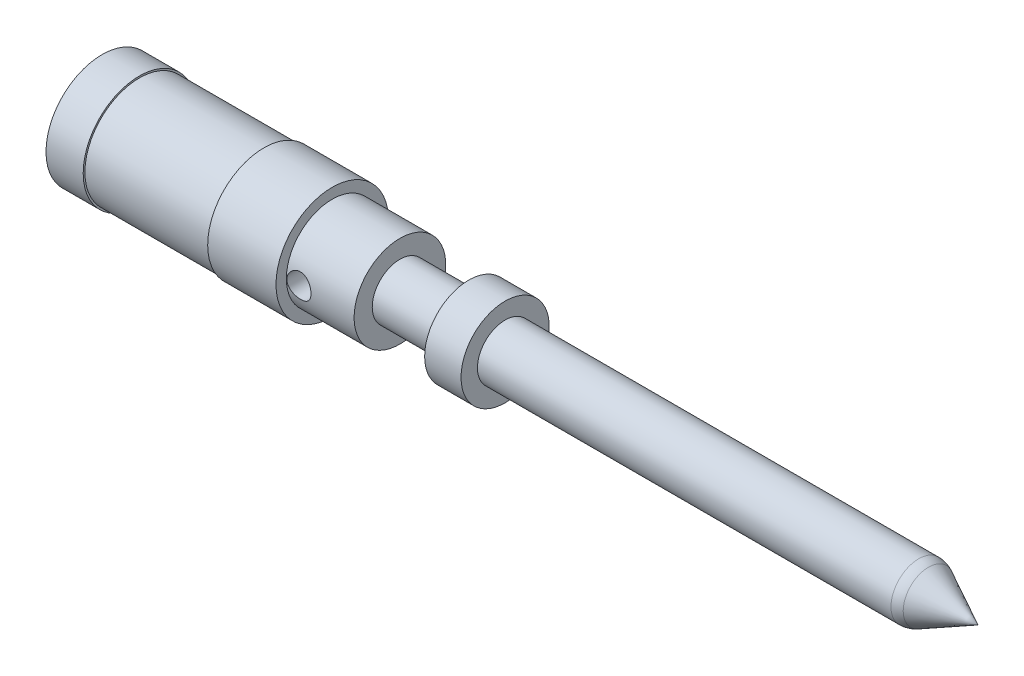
ISO-10303-21;
HEADER;
FILE_DESCRIPTION(('STEP AP214'),'2;1');
FILE_NAME('part.step','',(''),(''),'','','');
FILE_SCHEMA(('AUTOMOTIVE_DESIGN { 1 0 10303 214 1 1 1 1 }'));
ENDSEC;
DATA;
#1=APPLICATION_CONTEXT('core data for automotive mechanical design processes');
#2=APPLICATION_PROTOCOL_DEFINITION('international standard','automotive_design',2000,#1);
#3=PRODUCT_CONTEXT('',#1,'mechanical');
#4=PRODUCT('Part','Part','',(#3));
#5=PRODUCT_RELATED_PRODUCT_CATEGORY('part','',(#4));
#6=PRODUCT_DEFINITION_FORMATION('','',#4);
#7=PRODUCT_DEFINITION_CONTEXT('part definition',#1,'design');
#8=PRODUCT_DEFINITION('design','',#6,#7);
#9=PRODUCT_DEFINITION_SHAPE('','',#8);
#10=(LENGTH_UNIT() NAMED_UNIT(*) SI_UNIT(.MILLI.,.METRE.));
#11=(NAMED_UNIT(*) PLANE_ANGLE_UNIT() SI_UNIT($,.RADIAN.));
#12=(NAMED_UNIT(*) SI_UNIT($,.STERADIAN.) SOLID_ANGLE_UNIT());
#13=UNCERTAINTY_MEASURE_WITH_UNIT(LENGTH_MEASURE(1.E-05),#10,'distance_accuracy_value','');
#14=(GEOMETRIC_REPRESENTATION_CONTEXT(3) GLOBAL_UNCERTAINTY_ASSIGNED_CONTEXT((#13)) GLOBAL_UNIT_ASSIGNED_CONTEXT((#10,
#11,#12)) REPRESENTATION_CONTEXT('',''));
#15=CARTESIAN_POINT('',(0.,0.,0.));
#16=DIRECTION('',(0.,0.,1.));
#17=DIRECTION('',(1.,0.,0.));
#18=AXIS2_PLACEMENT_3D('',#15,#16,#17);
#19=CARTESIAN_POINT('',(0.,0.,0.));
#20=DIRECTION('',(-1.,0.,0.));
#21=DIRECTION('',(0.,0.,1.));
#22=AXIS2_PLACEMENT_3D('',#19,#20,#21);
#23=CYLINDRICAL_SURFACE('',#22,1.3462);
#24=CARTESIAN_POINT('',(6.02176145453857,0.,0.));
#25=DIRECTION('',(-1.,0.,0.));
#26=DIRECTION('',(0.,0.,1.));
#27=AXIS2_PLACEMENT_3D('',#24,#25,#26);
#28=CIRCLE('',#27,1.3462);
#29=CARTESIAN_POINT('',(6.02176145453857,0.,1.3462));
#30=VERTEX_POINT('',#29);
#31=EDGE_CURVE('E159',#30,#30,#28,.T.);
#32=ORIENTED_EDGE('',*,*,#31,.F.);
#33=EDGE_LOOP('',(#32));
#34=FACE_BOUND('',#33,.T.);
#35=CARTESIAN_POINT('',(8.0110066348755,0.,0.));
#36=DIRECTION('',(-1.,0.,0.));
#37=DIRECTION('',(0.,0.,1.));
#38=AXIS2_PLACEMENT_3D('',#35,#36,#37);
#39=CIRCLE('',#38,1.3462);
#40=CARTESIAN_POINT('',(8.0110066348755,0.,1.3462));
#41=VERTEX_POINT('',#40);
#42=EDGE_CURVE('E156',#41,#41,#39,.T.);
#43=ORIENTED_EDGE('',*,*,#42,.T.);
#44=EDGE_LOOP('',(#43));
#45=FACE_BOUND('',#44,.T.);
#46=CARTESIAN_POINT('',(6.74463579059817,0.,1.3462));
#47=CARTESIAN_POINT('',(6.74563540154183,-0.019483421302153,1.34619969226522));
#48=CARTESIAN_POINT('',(6.74502142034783,-0.0390547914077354,1.34577284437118));
#49=CARTESIAN_POINT('',(6.74058985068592,-0.0777999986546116,1.34409011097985));
#50=CARTESIAN_POINT('',(6.73677076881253,-0.0969736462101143,1.34283383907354));
#51=CARTESIAN_POINT('',(6.72606766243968,-0.134354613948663,1.33961000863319));
#52=CARTESIAN_POINT('',(6.71918739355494,-0.152563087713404,1.33764332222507));
#53=CARTESIAN_POINT('',(6.70257797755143,-0.187558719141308,1.33318705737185));
#54=CARTESIAN_POINT('',(6.69284864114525,-0.204345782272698,1.33069744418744));
#55=CARTESIAN_POINT('',(6.6705884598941,-0.23640380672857,1.32538193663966));
#56=CARTESIAN_POINT('',(6.65800484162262,-0.251637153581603,1.32255025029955));
#57=CARTESIAN_POINT('',(6.63048490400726,-0.279806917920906,1.31687865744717));
#58=CARTESIAN_POINT('',(6.61554821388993,-0.292742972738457,1.31403874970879));
#59=CARTESIAN_POINT('',(6.58336207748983,-0.31622210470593,1.30858958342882));
#60=CARTESIAN_POINT('',(6.56607057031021,-0.326709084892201,1.30598643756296));
#61=CARTESIAN_POINT('',(6.52989166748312,-0.344614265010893,1.30137673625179));
#62=CARTESIAN_POINT('',(6.51100452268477,-0.352032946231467,1.29937008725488));
#63=CARTESIAN_POINT('',(6.47256120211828,-0.363436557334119,1.29622640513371));
#64=CARTESIAN_POINT('',(6.45302582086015,-0.367486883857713,1.29507286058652));
#65=CARTESIAN_POINT('',(6.41352175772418,-0.37225213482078,1.29371139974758));
#66=CARTESIAN_POINT('',(6.39355317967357,-0.372967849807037,1.29350325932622));
#67=CARTESIAN_POINT('',(6.354452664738,-0.371071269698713,1.29404839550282));
#68=CARTESIAN_POINT('',(6.33531487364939,-0.368568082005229,1.29477015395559));
#69=CARTESIAN_POINT('',(6.29774543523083,-0.360508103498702,1.29703726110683));
#70=CARTESIAN_POINT('',(6.27931382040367,-0.354951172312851,1.29858264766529));
#71=CARTESIAN_POINT('',(6.24356368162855,-0.340928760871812,1.30233428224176));
#72=CARTESIAN_POINT('',(6.22625097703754,-0.332449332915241,1.30454369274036));
#73=CARTESIAN_POINT('',(6.19326734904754,-0.312833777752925,1.30938581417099));
#74=CARTESIAN_POINT('',(6.17759675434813,-0.301697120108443,1.31201860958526));
#75=CARTESIAN_POINT('',(6.14775847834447,-0.276623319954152,1.31753713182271));
#76=CARTESIAN_POINT('',(6.13366281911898,-0.262601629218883,1.32042849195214));
#77=CARTESIAN_POINT('',(6.10799808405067,-0.232384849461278,1.32607980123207));
#78=CARTESIAN_POINT('',(6.09642927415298,-0.216189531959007,1.32883973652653));
#79=CARTESIAN_POINT('',(6.07600093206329,-0.181806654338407,1.33398148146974));
#80=CARTESIAN_POINT('',(6.06718061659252,-0.163594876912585,1.33635760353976));
#81=CARTESIAN_POINT('',(6.05275027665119,-0.125870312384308,1.34043668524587));
#82=CARTESIAN_POINT('',(6.04713963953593,-0.106357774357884,1.34213977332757));
#83=CARTESIAN_POINT('',(6.03942531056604,-0.0671092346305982,1.34466636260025));
#84=CARTESIAN_POINT('',(6.03723669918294,-0.0473912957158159,1.34551097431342));
#85=CARTESIAN_POINT('',(6.03618083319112,-0.00785004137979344,1.34632225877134));
#86=CARTESIAN_POINT('',(6.03731307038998,0.0119732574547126,1.34628906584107));
#87=CARTESIAN_POINT('',(6.04279557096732,0.0506588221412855,1.3453823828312));
#88=CARTESIAN_POINT('',(6.04706760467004,0.0695327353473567,1.34452916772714));
#89=CARTESIAN_POINT('',(6.05860406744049,0.106294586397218,1.34212349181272));
#90=CARTESIAN_POINT('',(6.0658686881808,0.124182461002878,1.34057098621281));
#91=CARTESIAN_POINT('',(6.08327064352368,0.158693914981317,1.33692761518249));
#92=CARTESIAN_POINT('',(6.09343925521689,0.17530108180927,1.33483091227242));
#93=CARTESIAN_POINT('',(6.11633149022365,0.206606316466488,1.33034534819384));
#94=CARTESIAN_POINT('',(6.12905558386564,0.221304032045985,1.32795643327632));
#95=CARTESIAN_POINT('',(6.15712453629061,0.248809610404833,1.32308319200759));
#96=CARTESIAN_POINT('',(6.17253358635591,0.261551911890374,1.32059808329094));
#97=CARTESIAN_POINT('',(6.20530165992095,0.284283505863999,1.31589228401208));
#98=CARTESIAN_POINT('',(6.22266073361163,0.29427272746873,1.31367160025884));
#99=CARTESIAN_POINT('',(6.25891621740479,0.311228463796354,1.30975861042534));
#100=CARTESIAN_POINT('',(6.2778168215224,0.318186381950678,1.3080678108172));
#101=CARTESIAN_POINT('',(6.31657114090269,0.328808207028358,1.30543860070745));
#102=CARTESIAN_POINT('',(6.33642464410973,0.332472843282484,1.30450002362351));
#103=CARTESIAN_POINT('',(6.37593440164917,0.336326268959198,1.30351176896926));
#104=CARTESIAN_POINT('',(6.39558102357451,0.336608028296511,1.30343831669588));
#105=CARTESIAN_POINT('',(6.43463532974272,0.333926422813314,1.30412784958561));
#106=CARTESIAN_POINT('',(6.45404302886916,0.330963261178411,1.3048907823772));
#107=CARTESIAN_POINT('',(6.49181820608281,0.321951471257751,1.30714293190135));
#108=CARTESIAN_POINT('',(6.51019579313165,0.315942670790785,1.30862276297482));
#109=CARTESIAN_POINT('',(6.54568818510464,0.301046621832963,1.31212941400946));
#110=CARTESIAN_POINT('',(6.56280283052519,0.292159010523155,1.31415630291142));
#111=CARTESIAN_POINT('',(6.59571110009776,0.271519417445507,1.31857695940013));
#112=CARTESIAN_POINT('',(6.61146554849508,0.259706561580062,1.32097805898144));
#113=CARTESIAN_POINT('',(6.64080338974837,0.233641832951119,1.32583608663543));
#114=CARTESIAN_POINT('',(6.65438624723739,0.219389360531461,1.32829302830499));
#115=CARTESIAN_POINT('',(6.67929431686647,0.188474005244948,1.33303471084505));
#116=CARTESIAN_POINT('',(6.69056339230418,0.171765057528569,1.33531448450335));
#117=CARTESIAN_POINT('',(6.7101240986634,0.13663754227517,1.33936411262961));
#118=CARTESIAN_POINT('',(6.71841756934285,0.118220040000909,1.34113428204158));
#119=CARTESIAN_POINT('',(6.73068813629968,0.0832789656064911,1.34371678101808));
#120=CARTESIAN_POINT('',(6.73514634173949,0.0669307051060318,1.34463770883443));
#121=CARTESIAN_POINT('',(6.74168639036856,0.0337436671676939,1.34587942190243));
#122=CARTESIAN_POINT('',(6.74376847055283,0.0169049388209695,1.34620026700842));
#123=CARTESIAN_POINT('',(6.74463579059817,0.,1.3462));
#124=B_SPLINE_CURVE_WITH_KNOTS('',3,(#46,#47,#48,#49,#50,#51,#52,#53,#54,#55,#56,#57,#58,#59,
#60,#61,#62,#63,#64,#65,#66,#67,#68,#69,#70,#71,#72,#73,#74,#75,#76,#77,#78,#79,#80,#81,#82,#83,
#84,#85,#86,#87,#88,#89,#90,#91,#92,#93,#94,#95,#96,#97,#98,#99,#100,#101,#102,#103,#104,#105,
#106,#107,#108,#109,#110,#111,#112,#113,#114,#115,#116,#117,#118,#119,#120,#121,#122,#123),
.UNSPECIFIED.,.T.,.F.,(4,2,2,2,2,2,2,2,2,2,2,2,2,2,2,2,2,2,2,2,2,2,2,2,2,2,2,2,2,2,2,2,2,2,2,2,
2,2,4),(0.,0.0584652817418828,0.116957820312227,0.175378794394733,0.233803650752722,
0.293412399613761,0.353030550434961,0.413903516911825,0.47476693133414,0.534419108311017,
0.594057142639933,0.651725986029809,0.70939748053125,0.767348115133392,0.82531032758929,
0.885306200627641,0.945308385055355,1.00613117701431,1.06694235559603,1.12621906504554,
1.18548670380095,1.24332567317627,1.3011683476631,1.35965915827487,1.41816074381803,
1.47832452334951,1.53848985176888,1.59882471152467,1.65914620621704,1.71780599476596,
1.77646211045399,1.83437024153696,1.89228567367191,1.9515259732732,2.01078085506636,
2.07133715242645,2.13185594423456,2.18258885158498,2.23331669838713),.UNSPECIFIED.);
#125=CARTESIAN_POINT('',(6.74463579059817,0.,1.3462));
#126=VERTEX_POINT('',#125);
#127=EDGE_CURVE('E91',#126,#126,#124,.T.);
#128=ORIENTED_EDGE('',*,*,#127,.T.);
#129=EDGE_LOOP('',(#128));
#130=FACE_BOUND('',#129,.T.);
#131=ADVANCED_FACE('F46',(#34,#45,#130),#23,.T.);
#132=CARTESIAN_POINT('',(4.01516145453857,1.6002,0.));
#133=DIRECTION('',(-1.,0.,0.));
#134=DIRECTION('',(0.,0.,1.));
#135=AXIS2_PLACEMENT_3D('',#132,#133,#134);
#136=PLANE('',#135);
#137=CARTESIAN_POINT('',(4.01516145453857,0.,0.));
#138=DIRECTION('',(-1.,0.,0.));
#139=DIRECTION('',(0.,0.,1.));
#140=AXIS2_PLACEMENT_3D('',#137,#138,#139);
#141=CIRCLE('',#140,1.651);
#142=CARTESIAN_POINT('',(4.01516145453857,0.,1.651));
#143=VERTEX_POINT('',#142);
#144=EDGE_CURVE('E99',#143,#143,#141,.T.);
#145=ORIENTED_EDGE('',*,*,#144,.T.);
#146=EDGE_LOOP('',(#145));
#147=FACE_BOUND('',#146,.T.);
#148=CARTESIAN_POINT('',(4.01516145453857,0.,0.));
#149=DIRECTION('',(-1.,0.,0.));
#150=DIRECTION('',(0.,0.,1.));
#151=AXIS2_PLACEMENT_3D('',#148,#149,#150);
#152=CIRCLE('',#151,1.6002);
#153=CARTESIAN_POINT('',(4.01516145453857,0.,1.6002));
#154=VERTEX_POINT('',#153);
#155=EDGE_CURVE('E188',#154,#154,#152,.T.);
#156=ORIENTED_EDGE('',*,*,#155,.F.);
#157=EDGE_LOOP('',(#156));
#158=FACE_BOUND('',#157,.T.);
#159=ADVANCED_FACE('F73',(#147,#158),#136,.T.);
#160=CARTESIAN_POINT('',(0.,0.,0.));
#161=DIRECTION('',(-1.,0.,0.));
#162=DIRECTION('',(0.,0.,1.));
#163=AXIS2_PLACEMENT_3D('',#160,#161,#162);
#164=CYLINDRICAL_SURFACE('',#163,1.651);
#165=CARTESIAN_POINT('',(6.02176145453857,0.,0.));
#166=DIRECTION('',(-1.,0.,0.));
#167=DIRECTION('',(0.,0.,1.));
#168=AXIS2_PLACEMENT_3D('',#165,#166,#167);
#169=CIRCLE('',#168,1.651);
#170=CARTESIAN_POINT('',(6.02176145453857,0.,1.651));
#171=VERTEX_POINT('',#170);
#172=EDGE_CURVE('E161',#171,#171,#169,.T.);
#173=ORIENTED_EDGE('',*,*,#172,.T.);
#174=EDGE_LOOP('',(#173));
#175=FACE_BOUND('',#174,.T.);
#176=ORIENTED_EDGE('',*,*,#144,.F.);
#177=EDGE_LOOP('',(#176));
#178=FACE_BOUND('',#177,.T.);
#179=ADVANCED_FACE('F79',(#175,#178),#164,.T.);
#180=CARTESIAN_POINT('',(6.02176145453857,1.651,0.));
#181=DIRECTION('',(1.,0.,0.));
#182=DIRECTION('',(0.,0.,-1.));
#183=AXIS2_PLACEMENT_3D('',#180,#181,#182);
#184=PLANE('',#183);
#185=ORIENTED_EDGE('',*,*,#31,.T.);
#186=EDGE_LOOP('',(#185));
#187=FACE_BOUND('',#186,.T.);
#188=ORIENTED_EDGE('',*,*,#172,.F.);
#189=EDGE_LOOP('',(#188));
#190=FACE_BOUND('',#189,.T.);
#191=ADVANCED_FACE('F88',(#187,#190),#184,.T.);
#192=CARTESIAN_POINT('',(8.0110066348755,1.3462,0.));
#193=DIRECTION('',(1.,0.,0.));
#194=DIRECTION('',(0.,0.,-1.));
#195=AXIS2_PLACEMENT_3D('',#192,#193,#194);
#196=PLANE('',#195);
#197=CARTESIAN_POINT('',(8.0110066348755,0.,0.));
#198=DIRECTION('',(-1.,0.,0.));
#199=DIRECTION('',(0.,0.,1.));
#200=AXIS2_PLACEMENT_3D('',#197,#198,#199);
#201=CIRCLE('',#200,0.8128);
#202=CARTESIAN_POINT('',(8.0110066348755,0.,0.8128));
#203=VERTEX_POINT('',#202);
#204=EDGE_CURVE('E153',#203,#203,#201,.T.);
#205=ORIENTED_EDGE('',*,*,#204,.T.);
#206=EDGE_LOOP('',(#205));
#207=FACE_BOUND('',#206,.T.);
#208=ORIENTED_EDGE('',*,*,#42,.F.);
#209=EDGE_LOOP('',(#208));
#210=FACE_BOUND('',#209,.T.);
#211=ADVANCED_FACE('F86',(#207,#210),#196,.T.);
#212=CARTESIAN_POINT('',(0.,0.,0.));
#213=DIRECTION('',(-1.,0.,0.));
#214=DIRECTION('',(0.,0.,1.));
#215=AXIS2_PLACEMENT_3D('',#212,#213,#214);
#216=CYLINDRICAL_SURFACE('',#215,0.8128);
#217=CARTESIAN_POINT('',(10.033,0.,0.));
#218=DIRECTION('',(-1.,0.,0.));
#219=DIRECTION('',(0.,0.,1.));
#220=AXIS2_PLACEMENT_3D('',#217,#218,#219);
#221=CIRCLE('',#220,0.8128);
#222=CARTESIAN_POINT('',(10.033,0.,0.8128));
#223=VERTEX_POINT('',#222);
#224=EDGE_CURVE('E150',#223,#223,#221,.T.);
#225=ORIENTED_EDGE('',*,*,#224,.T.);
#226=EDGE_LOOP('',(#225));
#227=FACE_BOUND('',#226,.T.);
#228=ORIENTED_EDGE('',*,*,#204,.F.);
#229=EDGE_LOOP('',(#228));
#230=FACE_BOUND('',#229,.T.);
#231=ADVANCED_FACE('F258',(#227,#230),#216,.T.);
#232=CARTESIAN_POINT('',(10.033,0.8128,0.));
#233=DIRECTION('',(-1.,0.,0.));
#234=DIRECTION('',(0.,0.,1.));
#235=AXIS2_PLACEMENT_3D('',#232,#233,#234);
#236=PLANE('',#235);
#237=CARTESIAN_POINT('',(10.033,0.,0.));
#238=DIRECTION('',(-1.,0.,0.));
#239=DIRECTION('',(0.,0.,1.));
#240=AXIS2_PLACEMENT_3D('',#237,#238,#239);
#241=CIRCLE('',#240,1.2954);
#242=CARTESIAN_POINT('',(10.033,0.,1.2954));
#243=VERTEX_POINT('',#242);
#244=EDGE_CURVE('E147',#243,#243,#241,.T.);
#245=ORIENTED_EDGE('',*,*,#244,.T.);
#246=EDGE_LOOP('',(#245));
#247=FACE_BOUND('',#246,.T.);
#248=ORIENTED_EDGE('',*,*,#224,.F.);
#249=EDGE_LOOP('',(#248));
#250=FACE_BOUND('',#249,.T.);
#251=ADVANCED_FACE('F248',(#247,#250),#236,.T.);
#252=CARTESIAN_POINT('',(0.,0.,0.));
#253=DIRECTION('',(-1.,0.,0.));
#254=DIRECTION('',(0.,0.,1.));
#255=AXIS2_PLACEMENT_3D('',#252,#253,#254);
#256=CYLINDRICAL_SURFACE('',#255,1.2954);
#257=CARTESIAN_POINT('',(11.1017614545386,0.,0.));
#258=DIRECTION('',(-1.,0.,0.));
#259=DIRECTION('',(0.,0.,1.));
#260=AXIS2_PLACEMENT_3D('',#257,#258,#259);
#261=CIRCLE('',#260,1.2954);
#262=CARTESIAN_POINT('',(11.1017614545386,0.,1.2954));
#263=VERTEX_POINT('',#262);
#264=EDGE_CURVE('E139',#263,#263,#261,.T.);
#265=ORIENTED_EDGE('',*,*,#264,.T.);
#266=EDGE_LOOP('',(#265));
#267=FACE_BOUND('',#266,.T.);
#268=ORIENTED_EDGE('',*,*,#244,.F.);
#269=EDGE_LOOP('',(#268));
#270=FACE_BOUND('',#269,.T.);
#271=ADVANCED_FACE('F237',(#267,#270),#256,.T.);
#272=CARTESIAN_POINT('',(11.1017614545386,1.2954,0.));
#273=DIRECTION('',(1.,0.,0.));
#274=DIRECTION('',(0.,0.,-1.));
#275=AXIS2_PLACEMENT_3D('',#272,#273,#274);
#276=PLANE('',#275);
#277=CARTESIAN_POINT('',(11.1017614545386,0.,0.));
#278=DIRECTION('',(-1.,0.,0.));
#279=DIRECTION('',(0.,0.,1.));
#280=AXIS2_PLACEMENT_3D('',#277,#278,#279);
#281=CIRCLE('',#280,0.8128);
#282=CARTESIAN_POINT('',(11.1017614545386,0.,0.8128));
#283=VERTEX_POINT('',#282);
#284=EDGE_CURVE('E136',#283,#283,#281,.T.);
#285=ORIENTED_EDGE('',*,*,#284,.T.);
#286=EDGE_LOOP('',(#285));
#287=FACE_BOUND('',#286,.T.);
#288=ORIENTED_EDGE('',*,*,#264,.F.);
#289=EDGE_LOOP('',(#288));
#290=FACE_BOUND('',#289,.T.);
#291=ADVANCED_FACE('F69',(#287,#290),#276,.T.);
#292=CARTESIAN_POINT('',(0.,0.,0.));
#293=DIRECTION('',(-1.,0.,0.));
#294=DIRECTION('',(0.,0.,1.));
#295=AXIS2_PLACEMENT_3D('',#292,#293,#294);
#296=CYLINDRICAL_SURFACE('',#295,0.8128);
#297=CARTESIAN_POINT('',(23.2502396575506,0.,0.));
#298=DIRECTION('',(1.,0.,0.));
#299=DIRECTION('',(0.,0.,-1.));
#300=AXIS2_PLACEMENT_3D('',#297,#298,#299);
#301=CIRCLE('',#300,0.8128);
#302=CARTESIAN_POINT('',(23.2502396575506,0.,-0.8128));
#303=VERTEX_POINT('',#302);
#304=EDGE_CURVE('E53',#303,#303,#301,.F.);
#305=ORIENTED_EDGE('',*,*,#304,.T.);
#306=EDGE_LOOP('',(#305));
#307=FACE_BOUND('',#306,.T.);
#308=ORIENTED_EDGE('',*,*,#284,.F.);
#309=EDGE_LOOP('',(#308));
#310=FACE_BOUND('',#309,.T.);
#311=ADVANCED_FACE('F59',(#307,#310),#296,.T.);
#312=CARTESIAN_POINT('',(23.4030909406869,0.,0.));
#313=DIRECTION('',(-1.,0.,0.));
#314=DIRECTION('',(0.,0.,1.));
#315=AXIS2_PLACEMENT_3D('',#312,#313,#314);
#316=CONICAL_SURFACE('',#315,0.8128,0.472433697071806);
#317=CARTESIAN_POINT('',(23.5391994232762,0.,0.));
#318=DIRECTION('',(1.,0.,0.));
#319=DIRECTION('',(0.,0.,-1.));
#320=AXIS2_PLACEMENT_3D('',#317,#318,#319);
#321=CIRCLE('',#320,0.743244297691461);
#322=CARTESIAN_POINT('',(23.5391994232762,0.,-0.743244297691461));
#323=VERTEX_POINT('',#322);
#324=EDGE_CURVE('E13',#323,#323,#321,.T.);
#325=ORIENTED_EDGE('',*,*,#324,.T.);
#326=EDGE_LOOP('',(#325));
#327=FACE_BOUND('',#326,.T.);
#328=CARTESIAN_POINT('',(24.9936,0.,0.));
#329=VERTEX_POINT('',#328);
#330=VERTEX_LOOP('',#329);
#331=FACE_BOUND('',#330,.T.);
#332=ADVANCED_FACE('F56',(#327,#331),#316,.T.);
#333=CARTESIAN_POINT('',(-0.734638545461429,1.651,0.));
#334=DIRECTION('',(1.,0.,0.));
#335=DIRECTION('',(0.,0.,-1.));
#336=AXIS2_PLACEMENT_3D('',#333,#334,#335);
#337=PLANE('',#336);
#338=CARTESIAN_POINT('',(-0.734638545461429,0.,0.));
#339=DIRECTION('',(-1.,0.,0.));
#340=DIRECTION('',(0.,0.,1.));
#341=AXIS2_PLACEMENT_3D('',#338,#339,#340);
#342=CIRCLE('',#341,1.1303);
#343=CARTESIAN_POINT('',(-0.734638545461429,0.,1.1303));
#344=VERTEX_POINT('',#343);
#345=EDGE_CURVE('E97',#344,#344,#342,.T.);
#346=ORIENTED_EDGE('',*,*,#345,.F.);
#347=EDGE_LOOP('',(#346));
#348=FACE_BOUND('',#347,.T.);
#349=CARTESIAN_POINT('',(-0.734638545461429,0.,0.));
#350=DIRECTION('',(-1.,0.,0.));
#351=DIRECTION('',(0.,0.,1.));
#352=AXIS2_PLACEMENT_3D('',#349,#350,#351);
#353=CIRCLE('',#352,1.651);
#354=CARTESIAN_POINT('',(-0.734638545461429,0.,1.651));
#355=VERTEX_POINT('',#354);
#356=EDGE_CURVE('E134',#355,#355,#353,.T.);
#357=ORIENTED_EDGE('',*,*,#356,.T.);
#358=EDGE_LOOP('',(#357));
#359=FACE_BOUND('',#358,.T.);
#360=ADVANCED_FACE('F58',(#348,#359),#337,.F.);
#361=CARTESIAN_POINT('',(0.,0.,0.));
#362=DIRECTION('',(-1.,0.,0.));
#363=DIRECTION('',(0.,0.,1.));
#364=AXIS2_PLACEMENT_3D('',#361,#362,#363);
#365=CYLINDRICAL_SURFACE('',#364,1.651);
#366=CARTESIAN_POINT('',(0.357561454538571,0.,0.));
#367=DIRECTION('',(-1.,0.,0.));
#368=DIRECTION('',(0.,0.,1.));
#369=AXIS2_PLACEMENT_3D('',#366,#367,#368);
#370=CIRCLE('',#369,1.651);
#371=CARTESIAN_POINT('',(0.357561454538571,0.,1.651));
#372=VERTEX_POINT('',#371);
#373=EDGE_CURVE('E131',#372,#372,#370,.T.);
#374=ORIENTED_EDGE('',*,*,#373,.T.);
#375=EDGE_LOOP('',(#374));
#376=FACE_BOUND('',#375,.T.);
#377=ORIENTED_EDGE('',*,*,#356,.F.);
#378=EDGE_LOOP('',(#377));
#379=FACE_BOUND('',#378,.T.);
#380=ADVANCED_FACE('F66',(#376,#379),#365,.T.);
#381=CARTESIAN_POINT('',(0.357561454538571,1.651,0.));
#382=DIRECTION('',(1.,0.,0.));
#383=DIRECTION('',(0.,0.,-1.));
#384=AXIS2_PLACEMENT_3D('',#381,#382,#383);
#385=PLANE('',#384);
#386=CARTESIAN_POINT('',(0.357561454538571,0.,0.));
#387=DIRECTION('',(-1.,0.,0.));
#388=DIRECTION('',(0.,0.,1.));
#389=AXIS2_PLACEMENT_3D('',#386,#387,#388);
#390=CIRCLE('',#389,1.6002);
#391=CARTESIAN_POINT('',(0.357561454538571,0.,1.6002));
#392=VERTEX_POINT('',#391);
#393=EDGE_CURVE('E141',#392,#392,#390,.T.);
#394=ORIENTED_EDGE('',*,*,#393,.T.);
#395=EDGE_LOOP('',(#394));
#396=FACE_BOUND('',#395,.T.);
#397=ORIENTED_EDGE('',*,*,#373,.F.);
#398=EDGE_LOOP('',(#397));
#399=FACE_BOUND('',#398,.T.);
#400=ADVANCED_FACE('F119',(#396,#399),#385,.T.);
#401=CARTESIAN_POINT('',(0.,0.,0.));
#402=DIRECTION('',(-1.,0.,0.));
#403=DIRECTION('',(0.,0.,1.));
#404=AXIS2_PLACEMENT_3D('',#401,#402,#403);
#405=CYLINDRICAL_SURFACE('',#404,1.6002);
#406=ORIENTED_EDGE('',*,*,#155,.T.);
#407=EDGE_LOOP('',(#406));
#408=FACE_BOUND('',#407,.T.);
#409=ORIENTED_EDGE('',*,*,#393,.F.);
#410=EDGE_LOOP('',(#409));
#411=FACE_BOUND('',#410,.T.);
#412=ADVANCED_FACE('F115',(#408,#411),#405,.T.);
#413=CARTESIAN_POINT('',(5.25976145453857,0.,0.));
#414=DIRECTION('',(-1.,0.,0.));
#415=DIRECTION('',(0.,0.,1.));
#416=AXIS2_PLACEMENT_3D('',#413,#414,#415);
#417=CYLINDRICAL_SURFACE('',#416,1.1303);
#418=CARTESIAN_POINT('',(5.25976145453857,0.,0.));
#419=DIRECTION('',(-1.,0.,0.));
#420=DIRECTION('',(0.,0.,1.));
#421=AXIS2_PLACEMENT_3D('',#418,#419,#420);
#422=CIRCLE('',#421,1.1303);
#423=CARTESIAN_POINT('',(5.25976145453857,0.,1.1303));
#424=VERTEX_POINT('',#423);
#425=EDGE_CURVE('E185',#424,#424,#422,.T.);
#426=CARTESIAN_POINT('',(5.25976145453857,0.,1.1303));
#427=CARTESIAN_POINT('',(5.1973197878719,0.,1.1303));
#428=CARTESIAN_POINT('',(5.13487812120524,0.,1.1303));
#429=CARTESIAN_POINT('',(5.0099947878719,0.,1.1303));
#430=CARTESIAN_POINT('',(4.94755312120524,0.,1.1303));
#431=CARTESIAN_POINT('',(4.8226697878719,0.,1.1303));
#432=CARTESIAN_POINT('',(4.76022812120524,0.,1.1303));
#433=CARTESIAN_POINT('',(4.6353447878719,0.,1.1303));
#434=CARTESIAN_POINT('',(4.57290312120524,0.,1.1303));
#435=CARTESIAN_POINT('',(4.4480197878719,0.,1.1303));
#436=CARTESIAN_POINT('',(4.38557812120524,0.,1.1303));
#437=CARTESIAN_POINT('',(4.2606947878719,0.,1.1303));
#438=CARTESIAN_POINT('',(4.19825312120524,0.,1.1303));
#439=CARTESIAN_POINT('',(4.0733697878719,0.,1.1303));
#440=CARTESIAN_POINT('',(4.01092812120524,0.,1.1303));
#441=CARTESIAN_POINT('',(3.8860447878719,0.,1.1303));
#442=CARTESIAN_POINT('',(3.82360312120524,0.,1.1303));
#443=CARTESIAN_POINT('',(3.69871978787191,0.,1.1303));
#444=CARTESIAN_POINT('',(3.63627812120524,0.,1.1303));
#445=CARTESIAN_POINT('',(3.5113947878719,0.,1.1303));
#446=CARTESIAN_POINT('',(3.44895312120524,0.,1.1303));
#447=CARTESIAN_POINT('',(3.3240697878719,0.,1.1303));
#448=CARTESIAN_POINT('',(3.26162812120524,0.,1.1303));
#449=CARTESIAN_POINT('',(3.1367447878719,0.,1.1303));
#450=CARTESIAN_POINT('',(3.07430312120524,0.,1.1303));
#451=CARTESIAN_POINT('',(2.9494197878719,0.,1.1303));
#452=CARTESIAN_POINT('',(2.88697812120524,0.,1.1303));
#453=CARTESIAN_POINT('',(2.7620947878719,0.,1.1303));
#454=CARTESIAN_POINT('',(2.69965312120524,0.,1.1303));
#455=CARTESIAN_POINT('',(2.5747697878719,0.,1.1303));
#456=CARTESIAN_POINT('',(2.51232812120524,0.,1.1303));
#457=CARTESIAN_POINT('',(2.3874447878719,0.,1.1303));
#458=CARTESIAN_POINT('',(2.32500312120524,0.,1.1303));
#459=CARTESIAN_POINT('',(2.2001197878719,0.,1.1303));
#460=CARTESIAN_POINT('',(2.13767812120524,0.,1.1303));
#461=CARTESIAN_POINT('',(2.01279478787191,0.,1.1303));
#462=CARTESIAN_POINT('',(1.95035312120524,0.,1.1303));
#463=CARTESIAN_POINT('',(1.8254697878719,0.,1.1303));
#464=CARTESIAN_POINT('',(1.76302812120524,0.,1.1303));
#465=CARTESIAN_POINT('',(1.6381447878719,0.,1.1303));
#466=CARTESIAN_POINT('',(1.57570312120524,0.,1.1303));
#467=CARTESIAN_POINT('',(1.4508197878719,0.,1.1303));
#468=CARTESIAN_POINT('',(1.38837812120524,0.,1.1303));
#469=CARTESIAN_POINT('',(1.2634947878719,0.,1.1303));
#470=CARTESIAN_POINT('',(1.20105312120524,0.,1.1303));
#471=CARTESIAN_POINT('',(1.0761697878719,0.,1.1303));
#472=CARTESIAN_POINT('',(1.01372812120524,0.,1.1303));
#473=CARTESIAN_POINT('',(0.888844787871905,0.,1.1303));
#474=CARTESIAN_POINT('',(0.826403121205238,0.,1.1303));
#475=CARTESIAN_POINT('',(0.701519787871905,0.,1.1303));
#476=CARTESIAN_POINT('',(0.639078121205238,0.,1.1303));
#477=CARTESIAN_POINT('',(0.514194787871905,0.,1.1303));
#478=CARTESIAN_POINT('',(0.451753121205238,0.,1.1303));
#479=CARTESIAN_POINT('',(0.326869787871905,0.,1.1303));
#480=CARTESIAN_POINT('',(0.264428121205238,0.,1.1303));
#481=CARTESIAN_POINT('',(0.139544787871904,0.,1.1303));
#482=CARTESIAN_POINT('',(0.0771031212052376,0.,1.1303));
#483=CARTESIAN_POINT('',(-0.0477802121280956,0.,1.1303));
#484=CARTESIAN_POINT('',(-0.110221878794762,0.,1.1303));
#485=CARTESIAN_POINT('',(-0.235105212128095,0.,1.1303));
#486=CARTESIAN_POINT('',(-0.297546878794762,0.,1.1303));
#487=CARTESIAN_POINT('',(-0.422430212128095,0.,1.1303));
#488=CARTESIAN_POINT('',(-0.484871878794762,0.,1.1303));
#489=CARTESIAN_POINT('',(-0.609755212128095,0.,1.1303));
#490=CARTESIAN_POINT('',(-0.672196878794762,0.,1.1303));
#491=CARTESIAN_POINT('',(-0.734638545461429,0.,1.1303));
#492=B_SPLINE_CURVE_WITH_KNOTS('',3,(#426,#427,#428,#429,#430,#431,#432,#433,#434,#435,#436,
#437,#438,#439,#440,#441,#442,#443,#444,#445,#446,#447,#448,#449,#450,#451,#452,#453,#454,#455,
#456,#457,#458,#459,#460,#461,#462,#463,#464,#465,#466,#467,#468,#469,#470,#471,#472,#473,#474,
#475,#476,#477,#478,#479,#480,#481,#482,#483,#484,#485,#486,#487,#488,#489,#490,#491),
.UNSPECIFIED.,.F.,.F.,(4,2,2,2,2,2,2,2,2,2,2,2,2,2,2,2,2,2,2,2,2,2,2,2,2,2,2,2,2,2,2,2,4),(0.,
0.187324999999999,0.37465,0.561974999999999,0.7493,0.936624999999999,1.12395,1.311275,1.4986,
1.685925,1.87325,2.060575,2.2479,2.435225,2.62255,2.809875,2.9972,3.184525,3.37185,3.559175,
3.7465,3.933825,4.12115,4.308475,4.4958,4.683125,4.87045,5.057775,5.2451,5.432425,5.61975,
5.807075,5.9944),.UNSPECIFIED.);
#493=EDGE_CURVE('BSEAM111',#424,#344,#492,.T.);
#494=ORIENTED_EDGE('',*,*,#425,.F.);
#495=ORIENTED_EDGE('',*,*,#345,.T.);
#496=ORIENTED_EDGE('',*,*,#493,.T.);
#497=ORIENTED_EDGE('',*,*,#493,.F.);
#498=EDGE_LOOP('',(#494,#496,#495,#497));
#499=FACE_BOUND('',#498,.T.);
#500=ADVANCED_FACE('F111',(#499),#417,.F.);
#501=CARTESIAN_POINT('',(5.25976145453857,0.,0.));
#502=DIRECTION('',(-1.,0.,0.));
#503=DIRECTION('',(0.,0.,1.));
#504=AXIS2_PLACEMENT_3D('',#501,#502,#503);
#505=PLANE('',#504);
#506=ORIENTED_EDGE('',*,*,#425,.T.);
#507=EDGE_LOOP('',(#506));
#508=FACE_BOUND('',#507,.T.);
#509=ADVANCED_FACE('F107',(#508),#505,.T.);
#510=CARTESIAN_POINT('',(6.39084199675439,-0.0181602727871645,5.9944));
#511=DIRECTION('',(0.,0.,-1.));
#512=DIRECTION('',(-1.,0.,0.));
#513=AXIS2_PLACEMENT_3D('',#510,#511,#512);
#514=CYLINDRICAL_SURFACE('',#513,0.354259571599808);
#515=ORIENTED_EDGE('',*,*,#127,.F.);
#516=EDGE_LOOP('',(#515));
#517=FACE_BOUND('',#516,.T.);
#518=CARTESIAN_POINT('',(6.39084199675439,-0.0181602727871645,0.));
#519=DIRECTION('',(0.,0.,1.));
#520=DIRECTION('',(1.,0.,0.));
#521=AXIS2_PLACEMENT_3D('',#518,#519,#520);
#522=CIRCLE('',#521,0.354259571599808);
#523=CARTESIAN_POINT('',(6.7451015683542,-0.0181602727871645,0.));
#524=VERTEX_POINT('',#523);
#525=EDGE_CURVE('E98',#524,#524,#522,.T.);
#526=ORIENTED_EDGE('',*,*,#525,.F.);
#527=EDGE_LOOP('',(#526));
#528=FACE_BOUND('',#527,.T.);
#529=ADVANCED_FACE('F101',(#517,#528),#514,.F.);
#530=CARTESIAN_POINT('',(6.39084199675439,-0.0181602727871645,0.));
#531=DIRECTION('',(0.,0.,1.));
#532=DIRECTION('',(1.,0.,0.));
#533=AXIS2_PLACEMENT_3D('',#530,#531,#532);
#534=PLANE('',#533);
#535=ORIENTED_EDGE('',*,*,#525,.T.);
#536=EDGE_LOOP('',(#535));
#537=FACE_BOUND('',#536,.T.);
#538=ADVANCED_FACE('F106',(#537),#534,.T.);
#539=CARTESIAN_POINT('',(23.2502396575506,0.,0.));
#540=DIRECTION('',(1.,0.,0.));
#541=DIRECTION('',(0.,0.,-1.));
#542=AXIS2_PLACEMENT_3D('',#539,#540,#541);
#543=DEGENERATE_TOROIDAL_SURFACE('',#542,0.1778,0.635,.T.);
#544=ORIENTED_EDGE('',*,*,#324,.F.);
#545=EDGE_LOOP('',(#544));
#546=FACE_BOUND('',#545,.T.);
#547=ORIENTED_EDGE('',*,*,#304,.F.);
#548=EDGE_LOOP('',(#547));
#549=FACE_BOUND('',#548,.T.);
#550=ADVANCED_FACE('F48',(#546,#549),#543,.T.);
#551=CLOSED_SHELL('',(#131,#159,#179,#191,#211,#231,#251,#271,#291,#311,#332,#360,#380,#400,
#412,#500,#509,#529,#538,#550));
#552=MANIFOLD_SOLID_BREP('B2',#551);
#553=ADVANCED_BREP_SHAPE_REPRESENTATION('',(#18,#552),#14);
#554=SHAPE_DEFINITION_REPRESENTATION(#9,#553);
ENDSEC;
END-ISO-10303-21;
